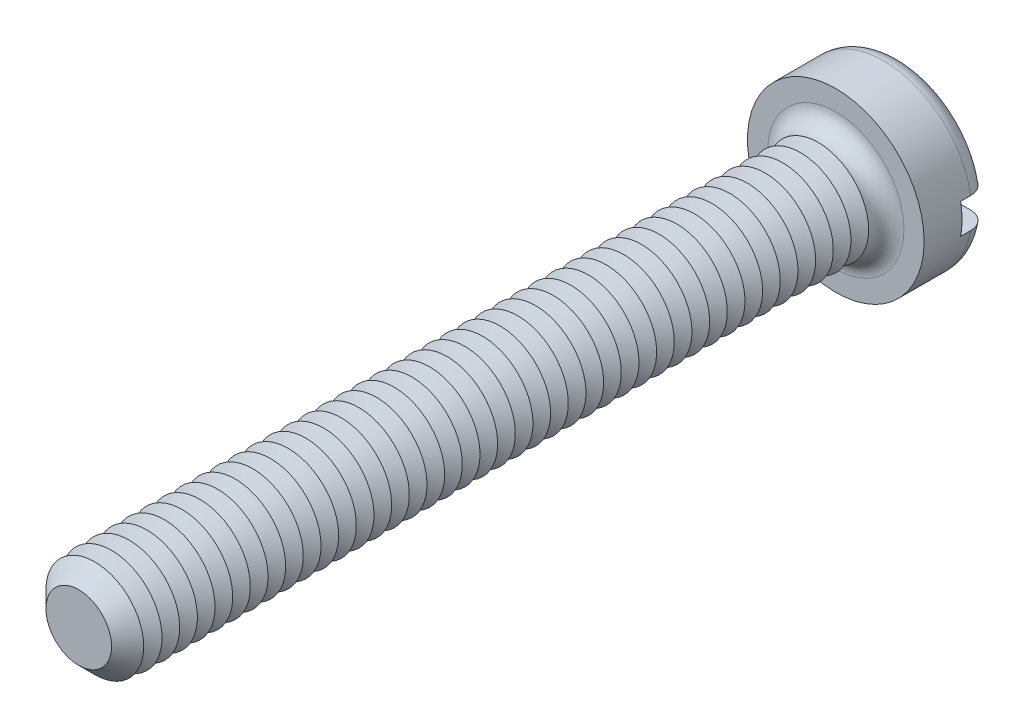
from build123d import *

# Parameters (mm, degrees)
SKETCH3_R           = 3.5
BOSS_EXTRUDE2_DEPTH = 2.6
SKETCH4_R           = 2
BOSS_EXTRUDE3_DEPTH = 30
FILLET1_R           = 0.7
CHAMFER1_SIZE       = 0.7
LPATTERN1_COUNT     = 41
LPATTERN1_PITCH     = 0.7
SKETCH8_W           = 7
SKETCH8_H           = 1.2
CUT_EXTRUDE1_DEPTH  = 1.1


with BuildPart() as part:
    # Sketch3 → Boss-Extrude2 (new body)
    with BuildSketch(Plane.XY):
        Circle(SKETCH3_R)
    extrude(amount=-BOSS_EXTRUDE2_DEPTH)

    # Sketch4 → Boss-Extrude3 (add)
    with BuildSketch(Plane.XY):
        Circle(SKETCH4_R)
    extrude(amount=BOSS_EXTRUDE3_DEPTH)

    # Fillet1
    fillet1_edges = [part.edges().sort_by_distance(p)[0] for p in [
        (-3.5, 0, -2.6),
        (-2, 0, 0),
    ]]
    fillet(fillet1_edges, radius=FILLET1_R)

    # Chamfer1
    chamfer1_edges = [part.edges().sort_by_distance(p)[0] for p in [
        (-2, 0, 30),
    ]]
    chamfer(chamfer1_edges, length=CHAMFER1_SIZE)

    # Sketch6 → Cut-Revolve1 (revolve, cut)
    with BuildSketch(Plane(origin=(0, 0, 0), x_dir=(0, 0, -1), z_dir=(1, 0, 0)), mode=Mode.PRIVATE) as cut_revolve1_sk:
        Polygon((-0.7, 2), (-1.05, 1.393782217), (-1.4, 2), align=None)
    cut_revolve1 = revolve(cut_revolve1_sk.sketch.rotate(Axis((0, 0, -1.694361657), (0, 0, 1)), 90), axis=Axis((0, 0, -1.694361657), (0, 0, 1)), mode=Mode.SUBTRACT)

    # LPattern1: Cut-Revolve1 ×41
    with Locations(*[(0, 0, i * LPATTERN1_PITCH) for i in range(1, LPATTERN1_COUNT)]):
        add(cut_revolve1, mode=Mode.SUBTRACT)

    # Sketch8 → Cut-Extrude1 (cut)
    with BuildSketch(Plane(origin=(0, 0, -2.6), x_dir=(-1, 0, 0), z_dir=(0, 0, -1))):
        Rectangle(SKETCH8_W, SKETCH8_H)
    extrude(amount=-CUT_EXTRUDE1_DEPTH, mode=Mode.SUBTRACT)


solid = part.part
